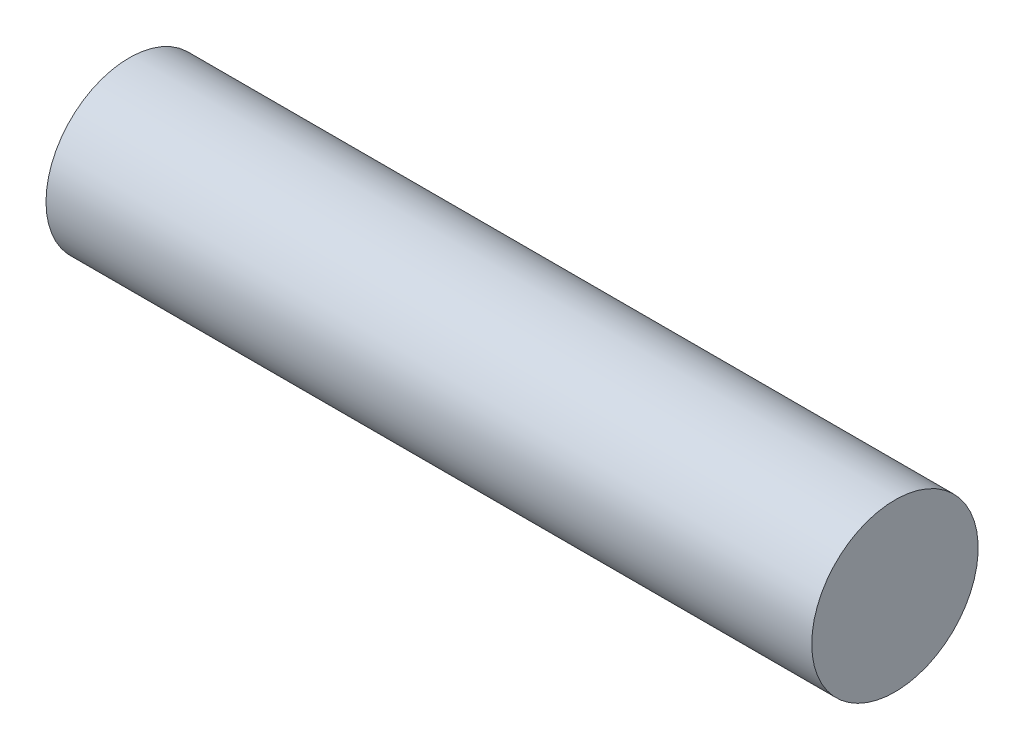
ISO-10303-21;
HEADER;
FILE_DESCRIPTION(('STEP AP214'),'2;1');
FILE_NAME('part.step','',(''),(''),'','','');
FILE_SCHEMA(('AUTOMOTIVE_DESIGN { 1 0 10303 214 1 1 1 1 }'));
ENDSEC;
DATA;
#1=APPLICATION_CONTEXT('core data for automotive mechanical design processes');
#2=APPLICATION_PROTOCOL_DEFINITION('international standard','automotive_design',2000,#1);
#3=PRODUCT_CONTEXT('',#1,'mechanical');
#4=PRODUCT('Part','Part','',(#3));
#5=PRODUCT_RELATED_PRODUCT_CATEGORY('part','',(#4));
#6=PRODUCT_DEFINITION_FORMATION('','',#4);
#7=PRODUCT_DEFINITION_CONTEXT('part definition',#1,'design');
#8=PRODUCT_DEFINITION('design','',#6,#7);
#9=PRODUCT_DEFINITION_SHAPE('','',#8);
#10=(LENGTH_UNIT() NAMED_UNIT(*) SI_UNIT(.MILLI.,.METRE.));
#11=(NAMED_UNIT(*) PLANE_ANGLE_UNIT() SI_UNIT($,.RADIAN.));
#12=(NAMED_UNIT(*) SI_UNIT($,.STERADIAN.) SOLID_ANGLE_UNIT());
#13=UNCERTAINTY_MEASURE_WITH_UNIT(LENGTH_MEASURE(1.E-05),#10,'distance_accuracy_value','');
#14=(GEOMETRIC_REPRESENTATION_CONTEXT(3) GLOBAL_UNCERTAINTY_ASSIGNED_CONTEXT((#13)) GLOBAL_UNIT_ASSIGNED_CONTEXT((#10,
#11,#12)) REPRESENTATION_CONTEXT('',''));
#15=CARTESIAN_POINT('',(0.,0.,0.));
#16=DIRECTION('',(0.,0.,1.));
#17=DIRECTION('',(1.,0.,0.));
#18=AXIS2_PLACEMENT_3D('',#15,#16,#17);
#19=CARTESIAN_POINT('',(26.,0.,0.));
#20=DIRECTION('',(-1.,0.,0.));
#21=DIRECTION('',(0.,0.,1.));
#22=AXIS2_PLACEMENT_3D('',#19,#20,#21);
#23=CYLINDRICAL_SURFACE('',#22,2.825);
#24=CARTESIAN_POINT('',(26.,0.,0.));
#25=DIRECTION('',(1.,0.,0.));
#26=DIRECTION('',(0.,0.,-1.));
#27=AXIS2_PLACEMENT_3D('',#24,#25,#26);
#28=CIRCLE('',#27,2.825);
#29=CARTESIAN_POINT('',(26.,0.,2.825));
#30=VERTEX_POINT('',#29);
#31=EDGE_CURVE('E11',#30,#30,#28,.T.);
#32=CARTESIAN_POINT('',(0.,0.,0.));
#33=DIRECTION('',(1.,0.,0.));
#34=DIRECTION('',(0.,0.,-1.));
#35=AXIS2_PLACEMENT_3D('',#32,#33,#34);
#36=CIRCLE('',#35,2.825);
#37=CARTESIAN_POINT('',(0.,0.,2.825));
#38=VERTEX_POINT('',#37);
#39=EDGE_CURVE('E42',#38,#38,#36,.T.);
#40=CARTESIAN_POINT('',(26.,0.,2.825));
#41=CARTESIAN_POINT('',(25.7291666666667,0.,2.825));
#42=CARTESIAN_POINT('',(25.4583333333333,0.,2.825));
#43=CARTESIAN_POINT('',(24.9166666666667,0.,2.825));
#44=CARTESIAN_POINT('',(24.6458333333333,0.,2.825));
#45=CARTESIAN_POINT('',(24.1041666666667,0.,2.825));
#46=CARTESIAN_POINT('',(23.8333333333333,0.,2.825));
#47=CARTESIAN_POINT('',(23.2916666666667,0.,2.825));
#48=CARTESIAN_POINT('',(23.0208333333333,0.,2.825));
#49=CARTESIAN_POINT('',(22.4791666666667,0.,2.825));
#50=CARTESIAN_POINT('',(22.2083333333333,0.,2.825));
#51=CARTESIAN_POINT('',(21.6666666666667,0.,2.825));
#52=CARTESIAN_POINT('',(21.3958333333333,0.,2.825));
#53=CARTESIAN_POINT('',(20.8541666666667,0.,2.825));
#54=CARTESIAN_POINT('',(20.5833333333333,0.,2.825));
#55=CARTESIAN_POINT('',(20.0416666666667,0.,2.825));
#56=CARTESIAN_POINT('',(19.7708333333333,0.,2.825));
#57=CARTESIAN_POINT('',(19.2291666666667,0.,2.825));
#58=CARTESIAN_POINT('',(18.9583333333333,0.,2.825));
#59=CARTESIAN_POINT('',(18.4166666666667,0.,2.825));
#60=CARTESIAN_POINT('',(18.1458333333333,0.,2.825));
#61=CARTESIAN_POINT('',(17.6041666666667,0.,2.825));
#62=CARTESIAN_POINT('',(17.3333333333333,0.,2.825));
#63=CARTESIAN_POINT('',(16.7916666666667,0.,2.825));
#64=CARTESIAN_POINT('',(16.5208333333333,0.,2.825));
#65=CARTESIAN_POINT('',(15.9791666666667,0.,2.825));
#66=CARTESIAN_POINT('',(15.7083333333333,0.,2.825));
#67=CARTESIAN_POINT('',(15.1666666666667,0.,2.825));
#68=CARTESIAN_POINT('',(14.8958333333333,0.,2.825));
#69=CARTESIAN_POINT('',(14.3541666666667,0.,2.825));
#70=CARTESIAN_POINT('',(14.0833333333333,0.,2.825));
#71=CARTESIAN_POINT('',(13.5416666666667,0.,2.825));
#72=CARTESIAN_POINT('',(13.2708333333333,0.,2.825));
#73=CARTESIAN_POINT('',(12.7291666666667,0.,2.825));
#74=CARTESIAN_POINT('',(12.4583333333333,0.,2.825));
#75=CARTESIAN_POINT('',(11.9166666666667,0.,2.825));
#76=CARTESIAN_POINT('',(11.6458333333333,0.,2.825));
#77=CARTESIAN_POINT('',(11.1041666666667,0.,2.825));
#78=CARTESIAN_POINT('',(10.8333333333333,0.,2.825));
#79=CARTESIAN_POINT('',(10.2916666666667,0.,2.825));
#80=CARTESIAN_POINT('',(10.0208333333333,0.,2.825));
#81=CARTESIAN_POINT('',(9.47916666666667,0.,2.825));
#82=CARTESIAN_POINT('',(9.20833333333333,0.,2.825));
#83=CARTESIAN_POINT('',(8.66666666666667,0.,2.825));
#84=CARTESIAN_POINT('',(8.39583333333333,0.,2.825));
#85=CARTESIAN_POINT('',(7.85416666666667,0.,2.825));
#86=CARTESIAN_POINT('',(7.58333333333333,0.,2.825));
#87=CARTESIAN_POINT('',(7.04166666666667,0.,2.825));
#88=CARTESIAN_POINT('',(6.77083333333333,0.,2.825));
#89=CARTESIAN_POINT('',(6.22916666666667,0.,2.825));
#90=CARTESIAN_POINT('',(5.95833333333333,0.,2.825));
#91=CARTESIAN_POINT('',(5.41666666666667,0.,2.825));
#92=CARTESIAN_POINT('',(5.14583333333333,0.,2.825));
#93=CARTESIAN_POINT('',(4.60416666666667,0.,2.825));
#94=CARTESIAN_POINT('',(4.33333333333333,0.,2.825));
#95=CARTESIAN_POINT('',(3.79166666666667,0.,2.825));
#96=CARTESIAN_POINT('',(3.52083333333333,0.,2.825));
#97=CARTESIAN_POINT('',(2.97916666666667,0.,2.825));
#98=CARTESIAN_POINT('',(2.70833333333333,0.,2.825));
#99=CARTESIAN_POINT('',(2.16666666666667,0.,2.825));
#100=CARTESIAN_POINT('',(1.89583333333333,0.,2.825));
#101=CARTESIAN_POINT('',(1.35416666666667,0.,2.825));
#102=CARTESIAN_POINT('',(1.08333333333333,0.,2.825));
#103=CARTESIAN_POINT('',(0.541666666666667,0.,2.825));
#104=CARTESIAN_POINT('',(0.270833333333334,0.,2.825));
#105=CARTESIAN_POINT('',(0.,0.,2.825));
#106=B_SPLINE_CURVE_WITH_KNOTS('',3,(#40,#41,#42,#43,#44,#45,#46,#47,#48,#49,#50,#51,#52,#53,
#54,#55,#56,#57,#58,#59,#60,#61,#62,#63,#64,#65,#66,#67,#68,#69,#70,#71,#72,#73,#74,#75,#76,#77,
#78,#79,#80,#81,#82,#83,#84,#85,#86,#87,#88,#89,#90,#91,#92,#93,#94,#95,#96,#97,#98,#99,#100,
#101,#102,#103,#104,#105),.UNSPECIFIED.,.F.,.F.,(4,2,2,2,2,2,2,2,2,2,2,2,2,2,2,2,2,2,2,2,2,2,2,
2,2,2,2,2,2,2,2,2,4),(0.,0.812499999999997,1.625,2.4375,3.25,4.0625,4.875,5.6875,6.5,7.3125,
8.125,8.93749999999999,9.74999999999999,10.5625,11.375,12.1875,13.,13.8125,14.625,15.4375,16.25,
17.0625,17.875,18.6875,19.5,20.3125,21.125,21.9375,22.75,23.5625,24.375,25.1875,26.),.UNSPECIFIED.);
#107=EDGE_CURVE('BSEAM39',#30,#38,#106,.T.);
#108=ORIENTED_EDGE('',*,*,#31,.F.);
#109=ORIENTED_EDGE('',*,*,#39,.T.);
#110=ORIENTED_EDGE('',*,*,#107,.T.);
#111=ORIENTED_EDGE('',*,*,#107,.F.);
#112=EDGE_LOOP('',(#108,#110,#109,#111));
#113=FACE_BOUND('',#112,.T.);
#114=ADVANCED_FACE('F39',(#113),#23,.T.);
#115=CARTESIAN_POINT('',(26.,0.,0.));
#116=DIRECTION('',(1.,0.,0.));
#117=DIRECTION('',(0.,0.,-1.));
#118=AXIS2_PLACEMENT_3D('',#115,#116,#117);
#119=PLANE('',#118);
#120=ORIENTED_EDGE('',*,*,#31,.T.);
#121=EDGE_LOOP('',(#120));
#122=FACE_BOUND('',#121,.T.);
#123=ADVANCED_FACE('F99',(#122),#119,.T.);
#124=CARTESIAN_POINT('',(0.,0.,0.));
#125=DIRECTION('',(1.,0.,0.));
#126=DIRECTION('',(0.,0.,-1.));
#127=AXIS2_PLACEMENT_3D('',#124,#125,#126);
#128=PLANE('',#127);
#129=CARTESIAN_POINT('',(0.,0.,0.));
#130=DIRECTION('',(-1.,0.,0.));
#131=DIRECTION('',(0.,0.,1.));
#132=AXIS2_PLACEMENT_3D('',#129,#130,#131);
#133=CIRCLE('',#132,1.6);
#134=CARTESIAN_POINT('',(0.,-0.75,-1.41332940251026));
#135=VERTEX_POINT('',#134);
#136=CARTESIAN_POINT('',(0.,0.75,-1.41332940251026));
#137=VERTEX_POINT('',#136);
#138=EDGE_CURVE('E74',#135,#137,#133,.T.);
#139=ORIENTED_EDGE('',*,*,#138,.F.);
#140=DIRECTION('',(0.,-1.,0.));
#141=VECTOR('',#140,1.);
#142=CARTESIAN_POINT('',(0.,0.,-1.41332940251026));
#143=LINE('',#142,#141);
#144=EDGE_CURVE('E54',#137,#135,#143,.T.);
#145=ORIENTED_EDGE('',*,*,#144,.F.);
#146=EDGE_LOOP('',(#139,#145));
#147=FACE_BOUND('',#146,.T.);
#148=ORIENTED_EDGE('',*,*,#39,.F.);
#149=EDGE_LOOP('',(#148));
#150=FACE_BOUND('',#149,.T.);
#151=ADVANCED_FACE('F79',(#147,#150),#128,.F.);
#152=CARTESIAN_POINT('',(8.67,0.,-1.41332940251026));
#153=DIRECTION('',(0.,0.,-1.));
#154=DIRECTION('',(-1.,0.,0.));
#155=AXIS2_PLACEMENT_3D('',#152,#153,#154);
#156=PLANE('',#155);
#157=ORIENTED_EDGE('',*,*,#144,.T.);
#158=DIRECTION('',(-1.,0.,0.));
#159=VECTOR('',#158,1.);
#160=CARTESIAN_POINT('',(8.67,-0.75,-1.41332940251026));
#161=LINE('',#160,#159);
#162=CARTESIAN_POINT('',(8.67,-0.75,-1.41332940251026));
#163=VERTEX_POINT('',#162);
#164=EDGE_CURVE('E71',#163,#135,#161,.T.);
#165=ORIENTED_EDGE('',*,*,#164,.F.);
#166=DIRECTION('',(0.,-1.,0.));
#167=VECTOR('',#166,1.);
#168=CARTESIAN_POINT('',(8.67,0.,-1.41332940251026));
#169=LINE('',#168,#167);
#170=CARTESIAN_POINT('',(8.67,0.75,-1.41332940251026));
#171=VERTEX_POINT('',#170);
#172=EDGE_CURVE('E68',#171,#163,#169,.T.);
#173=ORIENTED_EDGE('',*,*,#172,.F.);
#174=DIRECTION('',(-1.,0.,0.));
#175=VECTOR('',#174,1.);
#176=CARTESIAN_POINT('',(8.67,0.75,-1.41332940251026));
#177=LINE('',#176,#175);
#178=EDGE_CURVE('E62',#171,#137,#177,.T.);
#179=ORIENTED_EDGE('',*,*,#178,.T.);
#180=EDGE_LOOP('',(#157,#165,#173,#179));
#181=FACE_BOUND('',#180,.T.);
#182=ADVANCED_FACE('F66',(#181),#156,.F.);
#183=CARTESIAN_POINT('',(8.67,0.,0.));
#184=DIRECTION('',(-1.,0.,0.));
#185=DIRECTION('',(0.,0.,1.));
#186=AXIS2_PLACEMENT_3D('',#183,#184,#185);
#187=CYLINDRICAL_SURFACE('',#186,1.6);
#188=ORIENTED_EDGE('',*,*,#138,.T.);
#189=ORIENTED_EDGE('',*,*,#178,.F.);
#190=CARTESIAN_POINT('',(8.67,0.,0.));
#191=DIRECTION('',(-1.,0.,0.));
#192=DIRECTION('',(0.,0.,1.));
#193=AXIS2_PLACEMENT_3D('',#190,#191,#192);
#194=CIRCLE('',#193,1.6);
#195=EDGE_CURVE('E84',#163,#171,#194,.T.);
#196=ORIENTED_EDGE('',*,*,#195,.F.);
#197=ORIENTED_EDGE('',*,*,#164,.T.);
#198=EDGE_LOOP('',(#188,#189,#196,#197));
#199=FACE_BOUND('',#198,.T.);
#200=ADVANCED_FACE('F75',(#199),#187,.F.);
#201=CARTESIAN_POINT('',(8.67,0.,0.));
#202=DIRECTION('',(-1.,0.,0.));
#203=DIRECTION('',(0.,0.,1.));
#204=AXIS2_PLACEMENT_3D('',#201,#202,#203);
#205=PLANE('',#204);
#206=ORIENTED_EDGE('',*,*,#172,.T.);
#207=ORIENTED_EDGE('',*,*,#195,.T.);
#208=EDGE_LOOP('',(#206,#207));
#209=FACE_BOUND('',#208,.T.);
#210=ADVANCED_FACE('F91',(#209),#205,.T.);
#211=CLOSED_SHELL('',(#114,#123,#151,#182,#200,#210));
#212=MANIFOLD_SOLID_BREP('B2',#211);
#213=ADVANCED_BREP_SHAPE_REPRESENTATION('',(#18,#212),#14);
#214=SHAPE_DEFINITION_REPRESENTATION(#9,#213);
ENDSEC;
END-ISO-10303-21;
